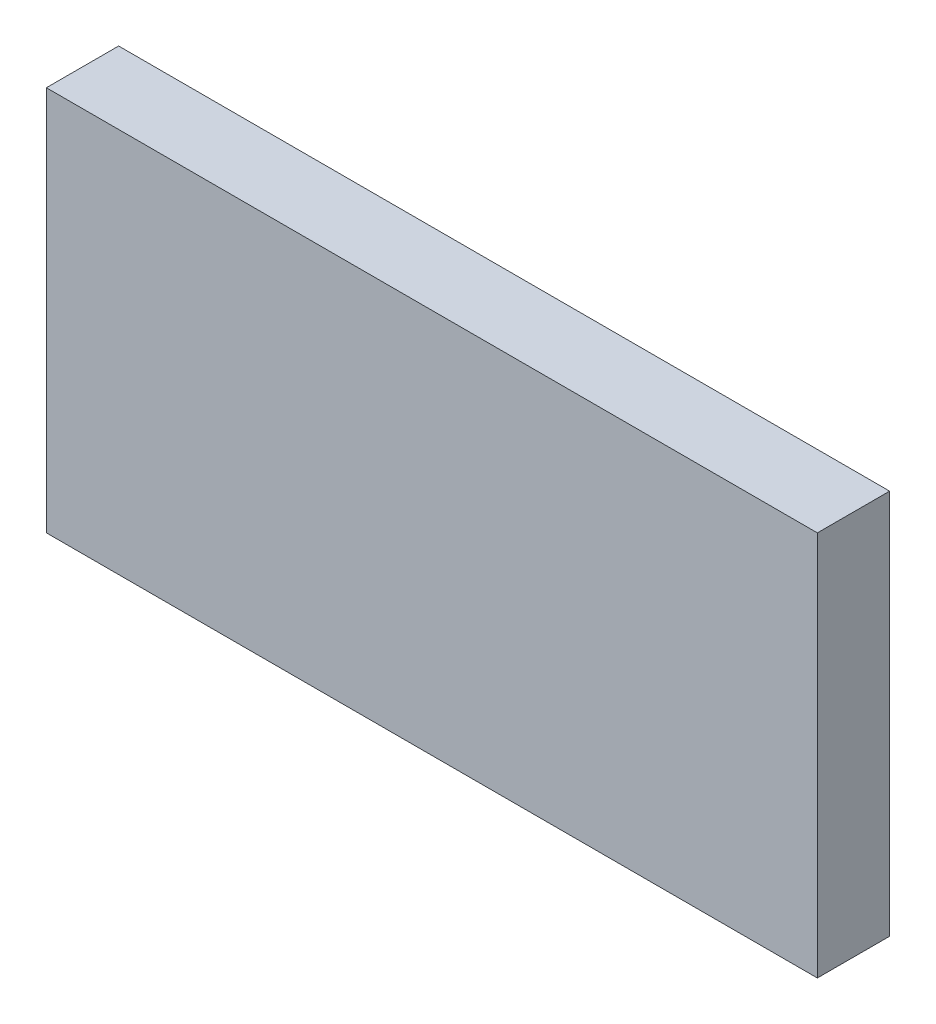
ISO-10303-21;
HEADER;
FILE_DESCRIPTION(('STEP AP214'),'2;1');
FILE_NAME('part.step','',(''),(''),'','','');
FILE_SCHEMA(('AUTOMOTIVE_DESIGN { 1 0 10303 214 1 1 1 1 }'));
ENDSEC;
DATA;
#1=APPLICATION_CONTEXT('core data for automotive mechanical design processes');
#2=APPLICATION_PROTOCOL_DEFINITION('international standard','automotive_design',2000,#1);
#3=PRODUCT_CONTEXT('',#1,'mechanical');
#4=PRODUCT('Part','Part','',(#3));
#5=PRODUCT_RELATED_PRODUCT_CATEGORY('part','',(#4));
#6=PRODUCT_DEFINITION_FORMATION('','',#4);
#7=PRODUCT_DEFINITION_CONTEXT('part definition',#1,'design');
#8=PRODUCT_DEFINITION('design','',#6,#7);
#9=PRODUCT_DEFINITION_SHAPE('','',#8);
#10=(LENGTH_UNIT() NAMED_UNIT(*) SI_UNIT(.MILLI.,.METRE.));
#11=(NAMED_UNIT(*) PLANE_ANGLE_UNIT() SI_UNIT($,.RADIAN.));
#12=(NAMED_UNIT(*) SI_UNIT($,.STERADIAN.) SOLID_ANGLE_UNIT());
#13=UNCERTAINTY_MEASURE_WITH_UNIT(LENGTH_MEASURE(1.E-05),#10,'distance_accuracy_value','');
#14=(GEOMETRIC_REPRESENTATION_CONTEXT(3) GLOBAL_UNCERTAINTY_ASSIGNED_CONTEXT((#13)) GLOBAL_UNIT_ASSIGNED_CONTEXT((#10,
#11,#12)) REPRESENTATION_CONTEXT('',''));
#15=CARTESIAN_POINT('',(0.,0.,0.));
#16=DIRECTION('',(0.,0.,1.));
#17=DIRECTION('',(1.,0.,0.));
#18=AXIS2_PLACEMENT_3D('',#15,#16,#17);
#19=CARTESIAN_POINT('',(0.,-101.6,0.));
#20=DIRECTION('',(-1.,0.,0.));
#21=DIRECTION('',(0.,0.,1.));
#22=AXIS2_PLACEMENT_3D('',#19,#20,#21);
#23=PLANE('',#22);
#24=DIRECTION('',(0.,0.,1.));
#25=VECTOR('',#24,1.);
#26=CARTESIAN_POINT('',(0.,0.,0.));
#27=LINE('',#26,#25);
#28=CARTESIAN_POINT('',(0.,0.,-19.05));
#29=VERTEX_POINT('',#28);
#30=CARTESIAN_POINT('',(0.,0.,0.));
#31=VERTEX_POINT('',#30);
#32=EDGE_CURVE('E96',#29,#31,#27,.T.);
#33=ORIENTED_EDGE('',*,*,#32,.F.);
#34=DIRECTION('',(0.,1.,0.));
#35=VECTOR('',#34,1.);
#36=CARTESIAN_POINT('',(0.,-101.6,-19.05));
#37=LINE('',#36,#35);
#38=CARTESIAN_POINT('',(0.,-101.6,-19.05));
#39=VERTEX_POINT('',#38);
#40=EDGE_CURVE('E11',#39,#29,#37,.T.);
#41=ORIENTED_EDGE('',*,*,#40,.F.);
#42=DIRECTION('',(0.,0.,1.));
#43=VECTOR('',#42,1.);
#44=CARTESIAN_POINT('',(0.,-101.6,0.));
#45=LINE('',#44,#43);
#46=CARTESIAN_POINT('',(0.,-101.6,0.));
#47=VERTEX_POINT('',#46);
#48=EDGE_CURVE('E90',#39,#47,#45,.T.);
#49=ORIENTED_EDGE('',*,*,#48,.T.);
#50=DIRECTION('',(0.,1.,0.));
#51=VECTOR('',#50,1.);
#52=CARTESIAN_POINT('',(0.,-101.6,0.));
#53=LINE('',#52,#51);
#54=EDGE_CURVE('E35',#47,#31,#53,.T.);
#55=ORIENTED_EDGE('',*,*,#54,.T.);
#56=EDGE_LOOP('',(#33,#41,#49,#55));
#57=FACE_BOUND('',#56,.T.);
#58=ADVANCED_FACE('F32',(#57),#23,.T.);
#59=CARTESIAN_POINT('',(0.,-101.6,-19.05));
#60=DIRECTION('',(0.,0.,-1.));
#61=DIRECTION('',(-1.,0.,0.));
#62=AXIS2_PLACEMENT_3D('',#59,#60,#61);
#63=PLANE('',#62);
#64=DIRECTION('',(-1.,0.,0.));
#65=VECTOR('',#64,1.);
#66=CARTESIAN_POINT('',(0.,0.,-19.05));
#67=LINE('',#66,#65);
#68=CARTESIAN_POINT('',(203.2,0.,-19.05));
#69=VERTEX_POINT('',#68);
#70=EDGE_CURVE('E92',#69,#29,#67,.T.);
#71=ORIENTED_EDGE('',*,*,#70,.F.);
#72=DIRECTION('',(0.,1.,0.));
#73=VECTOR('',#72,1.);
#74=CARTESIAN_POINT('',(203.2,-101.6,-19.05));
#75=LINE('',#74,#73);
#76=CARTESIAN_POINT('',(203.2,-101.6,-19.05));
#77=VERTEX_POINT('',#76);
#78=EDGE_CURVE('E41',#77,#69,#75,.T.);
#79=ORIENTED_EDGE('',*,*,#78,.F.);
#80=DIRECTION('',(-1.,0.,0.));
#81=VECTOR('',#80,1.);
#82=CARTESIAN_POINT('',(0.,-101.6,-19.05));
#83=LINE('',#82,#81);
#84=EDGE_CURVE('E87',#77,#39,#83,.T.);
#85=ORIENTED_EDGE('',*,*,#84,.T.);
#86=ORIENTED_EDGE('',*,*,#40,.T.);
#87=EDGE_LOOP('',(#71,#79,#85,#86));
#88=FACE_BOUND('',#87,.T.);
#89=ADVANCED_FACE('F106',(#88),#63,.T.);
#90=CARTESIAN_POINT('',(203.2,-101.6,0.));
#91=DIRECTION('',(1.,0.,0.));
#92=DIRECTION('',(0.,0.,-1.));
#93=AXIS2_PLACEMENT_3D('',#90,#91,#92);
#94=PLANE('',#93);
#95=DIRECTION('',(0.,0.,-1.));
#96=VECTOR('',#95,1.);
#97=CARTESIAN_POINT('',(203.2,0.,0.));
#98=LINE('',#97,#96);
#99=CARTESIAN_POINT('',(203.2,0.,0.));
#100=VERTEX_POINT('',#99);
#101=EDGE_CURVE('E82',#100,#69,#98,.T.);
#102=ORIENTED_EDGE('',*,*,#101,.F.);
#103=DIRECTION('',(0.,1.,0.));
#104=VECTOR('',#103,1.);
#105=CARTESIAN_POINT('',(203.2,-101.6,0.));
#106=LINE('',#105,#104);
#107=CARTESIAN_POINT('',(203.2,-101.6,0.));
#108=VERTEX_POINT('',#107);
#109=EDGE_CURVE('E77',#108,#100,#106,.T.);
#110=ORIENTED_EDGE('',*,*,#109,.F.);
#111=DIRECTION('',(0.,0.,-1.));
#112=VECTOR('',#111,1.);
#113=CARTESIAN_POINT('',(203.2,-101.6,0.));
#114=LINE('',#113,#112);
#115=EDGE_CURVE('E80',#108,#77,#114,.T.);
#116=ORIENTED_EDGE('',*,*,#115,.T.);
#117=ORIENTED_EDGE('',*,*,#78,.T.);
#118=EDGE_LOOP('',(#102,#110,#116,#117));
#119=FACE_BOUND('',#118,.T.);
#120=ADVANCED_FACE('F79',(#119),#94,.T.);
#121=CARTESIAN_POINT('',(0.,-101.6,0.));
#122=DIRECTION('',(0.,0.,1.));
#123=DIRECTION('',(1.,0.,0.));
#124=AXIS2_PLACEMENT_3D('',#121,#122,#123);
#125=PLANE('',#124);
#126=DIRECTION('',(1.,0.,0.));
#127=VECTOR('',#126,1.);
#128=CARTESIAN_POINT('',(0.,0.,0.));
#129=LINE('',#128,#127);
#130=EDGE_CURVE('E99',#31,#100,#129,.T.);
#131=ORIENTED_EDGE('',*,*,#130,.F.);
#132=ORIENTED_EDGE('',*,*,#54,.F.);
#133=DIRECTION('',(1.,0.,0.));
#134=VECTOR('',#133,1.);
#135=CARTESIAN_POINT('',(0.,-101.6,0.));
#136=LINE('',#135,#134);
#137=EDGE_CURVE('E86',#47,#108,#136,.T.);
#138=ORIENTED_EDGE('',*,*,#137,.T.);
#139=ORIENTED_EDGE('',*,*,#109,.T.);
#140=EDGE_LOOP('',(#131,#132,#138,#139));
#141=FACE_BOUND('',#140,.T.);
#142=ADVANCED_FACE('F89',(#141),#125,.T.);
#143=CARTESIAN_POINT('',(0.,-101.6,-19.05));
#144=DIRECTION('',(0.,-1.,0.));
#145=DIRECTION('',(0.,0.,-1.));
#146=AXIS2_PLACEMENT_3D('',#143,#144,#145);
#147=PLANE('',#146);
#148=ORIENTED_EDGE('',*,*,#48,.F.);
#149=ORIENTED_EDGE('',*,*,#84,.F.);
#150=ORIENTED_EDGE('',*,*,#115,.F.);
#151=ORIENTED_EDGE('',*,*,#137,.F.);
#152=EDGE_LOOP('',(#148,#149,#150,#151));
#153=FACE_BOUND('',#152,.T.);
#154=ADVANCED_FACE('F85',(#153),#147,.T.);
#155=CARTESIAN_POINT('',(0.,0.,-19.05));
#156=DIRECTION('',(0.,-1.,0.));
#157=DIRECTION('',(0.,0.,-1.));
#158=AXIS2_PLACEMENT_3D('',#155,#156,#157);
#159=PLANE('',#158);
#160=ORIENTED_EDGE('',*,*,#32,.T.);
#161=ORIENTED_EDGE('',*,*,#130,.T.);
#162=ORIENTED_EDGE('',*,*,#101,.T.);
#163=ORIENTED_EDGE('',*,*,#70,.T.);
#164=EDGE_LOOP('',(#160,#161,#162,#163));
#165=FACE_BOUND('',#164,.T.);
#166=ADVANCED_FACE('F105',(#165),#159,.F.);
#167=CLOSED_SHELL('',(#58,#89,#120,#142,#154,#166));
#168=MANIFOLD_SOLID_BREP('B2',#167);
#169=ADVANCED_BREP_SHAPE_REPRESENTATION('',(#18,#168),#14);
#170=SHAPE_DEFINITION_REPRESENTATION(#9,#169);
ENDSEC;
END-ISO-10303-21;
